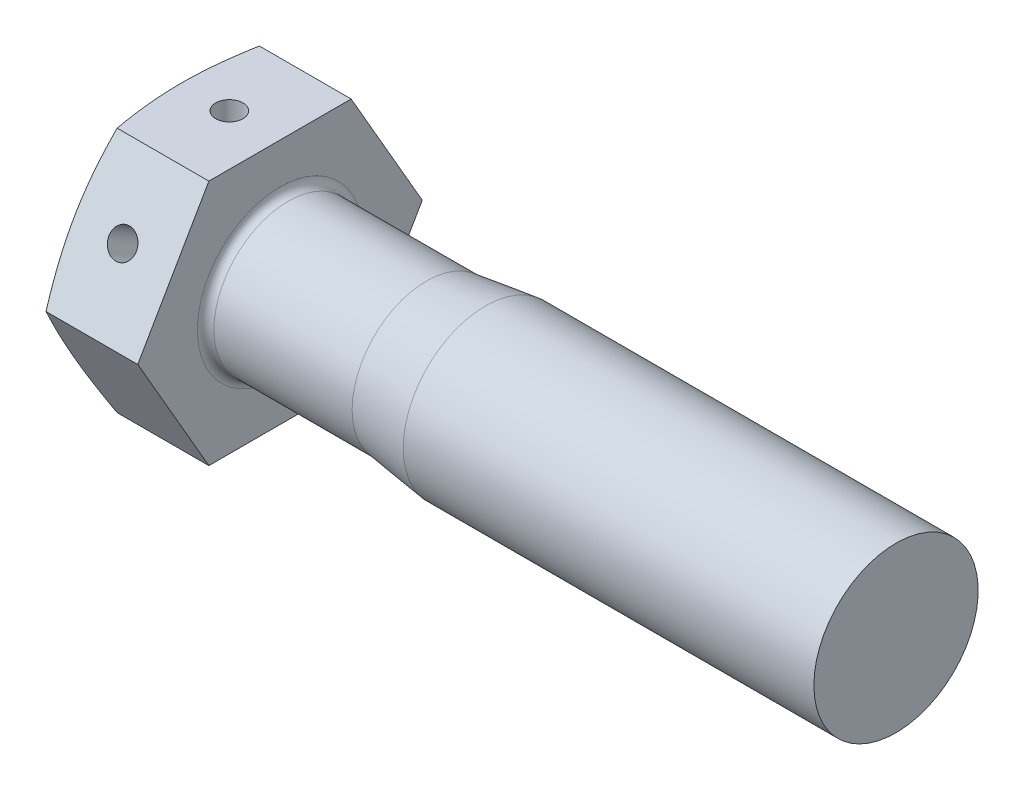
from build123d import *

# Parameters (mm, degrees)
BASEHEAD_DEPTH     = 7.5
SKETCH2_R          = 6
BASEBODY_DEPTH     = 45
SKETCH4_R          = 6.85
CUT_EXTRUDE1_DEPTH = 1.5
HEADFILLET_R       = 0.6
SKETCH6_R          = 1
HOLE_DEPTH         = 55.270157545
CIRPATTERN1_COUNT  = 2
CIRPATTERN1_ANGLE  = 60


with BuildPart() as part:
    # Sketch1 → BaseHead (new body)
    with BuildSketch(Plane(origin=(0, 0, 0), x_dir=(0, 0, -1), z_dir=(1, 0, 0))):
        Polygon((10.392304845, 0), (5.196152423, 9), (-5.196152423, 9), (-10.392304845, 0), (-5.196152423, -9), (5.196152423, -9), align=None)
    extrude(amount=BASEHEAD_DEPTH)

    # Sketch2 → BaseBody (add)
    with BuildSketch(Plane(origin=(7.5, 0, 0), x_dir=(0, 0, -1), z_dir=(1, 0, 0))):
        with Locations(Location((0, 0, 0), (0, 0, 180))):
            Circle(SKETCH2_R)
    extrude(amount=BASEBODY_DEPTH)

    # Sketch3 → HeadChamfer (revolve, cut)
    with BuildSketch(Plane(origin=(3.161211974, 0, 2.612290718), x_dir=(0, 0, -1), z_dir=(0, 1, 0)), mode=Mode.PRIVATE) as headchamfer_sk:
        Polygon((13.004595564, 3.161211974), (13.004595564, 2.363278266), (10.812290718, 3.161211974), align=None)
    revolve(headchamfer_sk.sketch.rotate(Axis((-2.071354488, 0, 0), (1, 0, 0)), 180), axis=Axis((-2.071354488, 0, 0), (1, 0, 0)), mode=Mode.SUBTRACT)

    # Sketch4 → Cut-Extrude1 (cut)
    with BuildSketch(Plane.ZY):
        Circle(SKETCH4_R)
    extrude(amount=-CUT_EXTRUDE1_DEPTH, mode=Mode.SUBTRACT)

    # Sketch5 → Cut-Revolve1 (revolve, cut)
    with BuildSketch(Plane(origin=(-2.92963122, 0, 7.92963122), x_dir=(0, 0, -1), z_dir=(0, 1, 0)), mode=Mode.PRIVATE) as cut_revolve1_sk:
        Polygon((13.92963122, -25.42963122), (13.36113122, -21.12963122), (13.36113122, -10.42963122), (18.79263122, -10.42963122), (18.79263122, -25.42963122), align=None)
    revolve(cut_revolve1_sk.sketch.rotate(Axis((-2.697175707, 0, 0), (1, 0, 0)), 180), axis=Axis((-2.697175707, 0, 0), (1, 0, 0)), mode=Mode.SUBTRACT)

    # HeadFillet
    headfillet_edges = [part.edges().sort_by_distance(p)[0] for p in [
        (7.5, 0, -5.4315),
    ]]
    fillet(headfillet_edges, radius=HEADFILLET_R)

    # Sketch6 → Hole (cut, symmetric)
    with BuildSketch(Plane(origin=(0, 0, 0), x_dir=(1, 0, 0), z_dir=(0, 1, 0))):
        with Locations(Location((3.8, 0, 0), (0, 0, 270))):
            Circle(SKETCH6_R)
    hole = extrude(amount=HOLE_DEPTH, both=True, mode=Mode.SUBTRACT)

    # CirPattern1: Hole ×2 about axis
    cirpattern1_axis = Axis((-2.697175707, 0, 0), (1, 0, 0))
    for i in range(1, CIRPATTERN1_COUNT):
        add(hole.rotate(cirpattern1_axis, i * CIRPATTERN1_ANGLE / (CIRPATTERN1_COUNT - 1)), mode=Mode.SUBTRACT)


solid = part.part
